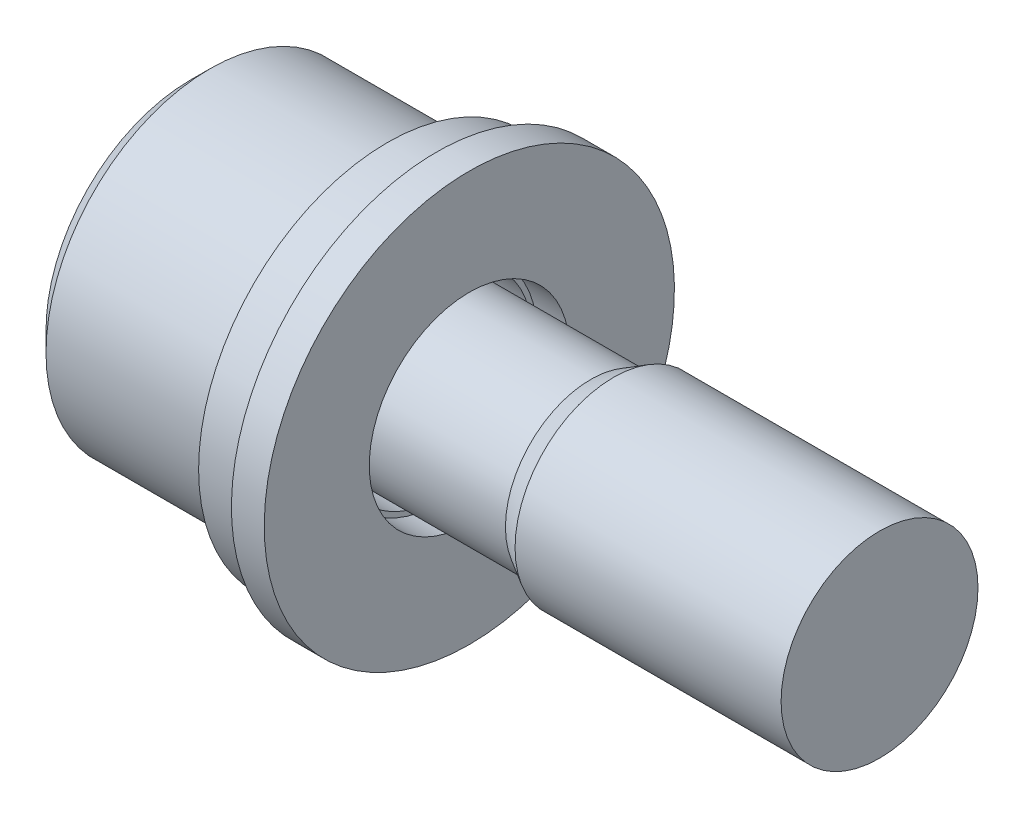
ISO-10303-21;
HEADER;
FILE_DESCRIPTION(('STEP AP214'),'2;1');
FILE_NAME('part.step','',(''),(''),'','','');
FILE_SCHEMA(('AUTOMOTIVE_DESIGN { 1 0 10303 214 1 1 1 1 }'));
ENDSEC;
DATA;
#1=APPLICATION_CONTEXT('core data for automotive mechanical design processes');
#2=APPLICATION_PROTOCOL_DEFINITION('international standard','automotive_design',2000,#1);
#3=PRODUCT_CONTEXT('',#1,'mechanical');
#4=PRODUCT('Part','Part','',(#3));
#5=PRODUCT_RELATED_PRODUCT_CATEGORY('part','',(#4));
#6=PRODUCT_DEFINITION_FORMATION('','',#4);
#7=PRODUCT_DEFINITION_CONTEXT('part definition',#1,'design');
#8=PRODUCT_DEFINITION('design','',#6,#7);
#9=PRODUCT_DEFINITION_SHAPE('','',#8);
#10=(LENGTH_UNIT() NAMED_UNIT(*) SI_UNIT(.MILLI.,.METRE.));
#11=(NAMED_UNIT(*) PLANE_ANGLE_UNIT() SI_UNIT($,.RADIAN.));
#12=(NAMED_UNIT(*) SI_UNIT($,.STERADIAN.) SOLID_ANGLE_UNIT());
#13=UNCERTAINTY_MEASURE_WITH_UNIT(LENGTH_MEASURE(1.E-05),#10,'distance_accuracy_value','');
#14=(GEOMETRIC_REPRESENTATION_CONTEXT(3) GLOBAL_UNCERTAINTY_ASSIGNED_CONTEXT((#13)) GLOBAL_UNIT_ASSIGNED_CONTEXT((#10,
#11,#12)) REPRESENTATION_CONTEXT('',''));
#15=CARTESIAN_POINT('',(0.,0.,0.));
#16=DIRECTION('',(0.,0.,1.));
#17=DIRECTION('',(1.,0.,0.));
#18=AXIS2_PLACEMENT_3D('',#15,#16,#17);
#19=CARTESIAN_POINT('',(-3.1,5.75,0.));
#20=DIRECTION('',(1.,0.,0.));
#21=DIRECTION('',(0.,1.,0.));
#22=AXIS2_PLACEMENT_3D('',#19,#20,#21);
#23=PLANE('',#22);
#24=CARTESIAN_POINT('',(-3.1,0.,0.));
#25=DIRECTION('',(-1.,0.,0.));
#26=DIRECTION('',(0.,-1.,0.));
#27=AXIS2_PLACEMENT_3D('',#24,#25,#26);
#28=CIRCLE('',#27,5.75);
#29=CARTESIAN_POINT('',(-3.1,-5.75,0.));
#30=VERTEX_POINT('',#29);
#31=EDGE_CURVE('E137',#30,#30,#28,.F.);
#32=ORIENTED_EDGE('',*,*,#31,.F.);
#33=EDGE_LOOP('',(#32));
#34=FACE_BOUND('',#33,.T.);
#35=CARTESIAN_POINT('',(-3.1,0.,0.));
#36=DIRECTION('',(1.,0.,0.));
#37=DIRECTION('',(0.,1.,0.));
#38=AXIS2_PLACEMENT_3D('',#35,#36,#37);
#39=CIRCLE('',#38,5.);
#40=CARTESIAN_POINT('',(-3.1,5.,0.));
#41=VERTEX_POINT('',#40);
#42=EDGE_CURVE('E156',#41,#41,#39,.F.);
#43=ORIENTED_EDGE('',*,*,#42,.F.);
#44=EDGE_LOOP('',(#43));
#45=FACE_BOUND('',#44,.T.);
#46=ADVANCED_FACE('F15',(#34,#45),#23,.F.);
#47=CARTESIAN_POINT('',(-9.1,0.,0.));
#48=DIRECTION('',(-1.,0.,0.));
#49=DIRECTION('',(0.,-1.,0.));
#50=AXIS2_PLACEMENT_3D('',#47,#48,#49);
#51=CYLINDRICAL_SURFACE('',#50,5.75);
#52=ORIENTED_EDGE('',*,*,#31,.T.);
#53=EDGE_LOOP('',(#52));
#54=FACE_BOUND('',#53,.T.);
#55=CARTESIAN_POINT('',(-1.6,0.,0.));
#56=DIRECTION('',(-1.,0.,0.));
#57=DIRECTION('',(0.,-1.,0.));
#58=AXIS2_PLACEMENT_3D('',#55,#56,#57);
#59=CIRCLE('',#58,5.75);
#60=CARTESIAN_POINT('',(-1.6,-5.75,0.));
#61=VERTEX_POINT('',#60);
#62=EDGE_CURVE('E131',#61,#61,#59,.T.);
#63=ORIENTED_EDGE('',*,*,#62,.T.);
#64=EDGE_LOOP('',(#63));
#65=FACE_BOUND('',#64,.T.);
#66=ADVANCED_FACE('F250',(#54,#65),#51,.T.);
#67=CARTESIAN_POINT('',(-1.6,5.75,0.));
#68=DIRECTION('',(1.,0.,0.));
#69=DIRECTION('',(0.,1.,0.));
#70=AXIS2_PLACEMENT_3D('',#67,#68,#69);
#71=PLANE('',#70);
#72=ORIENTED_EDGE('',*,*,#62,.F.);
#73=EDGE_LOOP('',(#72));
#74=FACE_BOUND('',#73,.T.);
#75=CARTESIAN_POINT('',(-1.6,0.,0.));
#76=DIRECTION('',(-1.,0.,0.));
#77=DIRECTION('',(0.,-1.,0.));
#78=AXIS2_PLACEMENT_3D('',#75,#76,#77);
#79=CIRCLE('',#78,6.25);
#80=CARTESIAN_POINT('',(-1.6,-6.25,0.));
#81=VERTEX_POINT('',#80);
#82=EDGE_CURVE('E126',#81,#81,#79,.F.);
#83=ORIENTED_EDGE('',*,*,#82,.F.);
#84=EDGE_LOOP('',(#83));
#85=FACE_BOUND('',#84,.T.);
#86=ADVANCED_FACE('F256',(#74,#85),#71,.F.);
#87=CARTESIAN_POINT('',(-9.1,0.,0.));
#88=DIRECTION('',(-1.,0.,0.));
#89=DIRECTION('',(0.,-1.,0.));
#90=AXIS2_PLACEMENT_3D('',#87,#88,#89);
#91=CYLINDRICAL_SURFACE('',#90,6.25);
#92=ORIENTED_EDGE('',*,*,#82,.T.);
#93=EDGE_LOOP('',(#92));
#94=FACE_BOUND('',#93,.T.);
#95=CARTESIAN_POINT('',(-0.6,0.,0.));
#96=DIRECTION('',(-1.,0.,0.));
#97=DIRECTION('',(0.,-1.,0.));
#98=AXIS2_PLACEMENT_3D('',#95,#96,#97);
#99=CIRCLE('',#98,6.25);
#100=CARTESIAN_POINT('',(-0.6,-6.25,0.));
#101=VERTEX_POINT('',#100);
#102=EDGE_CURVE('E19',#101,#101,#99,.T.);
#103=ORIENTED_EDGE('',*,*,#102,.T.);
#104=EDGE_LOOP('',(#103));
#105=FACE_BOUND('',#104,.T.);
#106=ADVANCED_FACE('F265',(#94,#105),#91,.T.);
#107=CARTESIAN_POINT('',(-0.6,2.6,0.));
#108=DIRECTION('',(-1.,0.,0.));
#109=DIRECTION('',(0.,-1.,0.));
#110=AXIS2_PLACEMENT_3D('',#107,#108,#109);
#111=PLANE('',#110);
#112=CARTESIAN_POINT('',(-0.6,0.,0.));
#113=DIRECTION('',(-1.,0.,0.));
#114=DIRECTION('',(0.,-1.,0.));
#115=AXIS2_PLACEMENT_3D('',#112,#113,#114);
#116=CIRCLE('',#115,3.05);
#117=CARTESIAN_POINT('',(-0.6,-3.05,0.));
#118=VERTEX_POINT('',#117);
#119=EDGE_CURVE('E163',#118,#118,#116,.F.);
#120=ORIENTED_EDGE('',*,*,#119,.F.);
#121=EDGE_LOOP('',(#120));
#122=FACE_BOUND('',#121,.T.);
#123=ORIENTED_EDGE('',*,*,#102,.F.);
#124=EDGE_LOOP('',(#123));
#125=FACE_BOUND('',#124,.T.);
#126=ADVANCED_FACE('F17',(#122,#125),#111,.F.);
#127=CARTESIAN_POINT('',(-9.1,0.,0.));
#128=DIRECTION('',(1.,0.,0.));
#129=DIRECTION('',(0.,1.,0.));
#130=AXIS2_PLACEMENT_3D('',#127,#128,#129);
#131=CYLINDRICAL_SURFACE('',#130,5.);
#132=CARTESIAN_POINT('',(-8.5,0.,0.));
#133=DIRECTION('',(1.,0.,0.));
#134=DIRECTION('',(0.,1.,0.));
#135=AXIS2_PLACEMENT_3D('',#132,#133,#134);
#136=CIRCLE('',#135,5.);
#137=CARTESIAN_POINT('',(-8.5,5.,0.));
#138=VERTEX_POINT('',#137);
#139=EDGE_CURVE('E10',#138,#138,#136,.T.);
#140=ORIENTED_EDGE('',*,*,#139,.T.);
#141=EDGE_LOOP('',(#140));
#142=FACE_BOUND('',#141,.T.);
#143=ORIENTED_EDGE('',*,*,#42,.T.);
#144=EDGE_LOOP('',(#143));
#145=FACE_BOUND('',#144,.T.);
#146=ADVANCED_FACE('F259',(#142,#145),#131,.T.);
#147=CARTESIAN_POINT('',(-6.10000000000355,0.,0.));
#148=DIRECTION('',(-1.,0.,0.));
#149=DIRECTION('',(0.,0.,1.));
#150=AXIS2_PLACEMENT_3D('',#147,#148,#149);
#151=CONICAL_SURFACE('',#150,2.49999999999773,1.04719755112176);
#152=CARTESIAN_POINT('',(-4.65662432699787,5.68431684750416E-11,0.));
#153=VERTEX_POINT('',#152);
#154=VERTEX_LOOP('',#153);
#155=FACE_BOUND('',#154,.T.);
#156=CARTESIAN_POINT('',(-6.10000000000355,0.,0.));
#157=DIRECTION('',(-1.,0.,0.));
#158=DIRECTION('',(0.,0.,1.));
#159=AXIS2_PLACEMENT_3D('',#156,#157,#158);
#160=CIRCLE('',#159,2.49999999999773);
#161=CARTESIAN_POINT('',(-6.10000000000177,2.1650635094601,1.24999999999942));
#162=VERTEX_POINT('',#161);
#163=CARTESIAN_POINT('',(-6.10000000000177,0.,2.49999999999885));
#164=VERTEX_POINT('',#163);
#165=EDGE_CURVE('E104',#162,#164,#160,.F.);
#166=ORIENTED_EDGE('',*,*,#165,.F.);
#167=CARTESIAN_POINT('',(-6.10000000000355,0.,0.));
#168=DIRECTION('',(-1.,0.,0.));
#169=DIRECTION('',(0.,0.,1.));
#170=AXIS2_PLACEMENT_3D('',#167,#168,#169);
#171=CIRCLE('',#170,2.49999999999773);
#172=CARTESIAN_POINT('',(-6.10000000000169,2.16506350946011,-1.24999999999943));
#173=VERTEX_POINT('',#172);
#174=EDGE_CURVE('E93',#173,#162,#171,.F.);
#175=ORIENTED_EDGE('',*,*,#174,.F.);
#176=CARTESIAN_POINT('',(-6.10000000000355,0.,0.));
#177=DIRECTION('',(-1.,0.,0.));
#178=DIRECTION('',(0.,0.,1.));
#179=AXIS2_PLACEMENT_3D('',#176,#177,#178);
#180=CIRCLE('',#179,2.49999999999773);
#181=CARTESIAN_POINT('',(-6.10000000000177,0.,-2.49999999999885));
#182=VERTEX_POINT('',#181);
#183=EDGE_CURVE('E92',#182,#173,#180,.F.);
#184=ORIENTED_EDGE('',*,*,#183,.F.);
#185=CARTESIAN_POINT('',(-6.10000000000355,0.,0.));
#186=DIRECTION('',(-1.,0.,0.));
#187=DIRECTION('',(0.,0.,1.));
#188=AXIS2_PLACEMENT_3D('',#185,#186,#187);
#189=CIRCLE('',#188,2.49999999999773);
#190=CARTESIAN_POINT('',(-6.10000000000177,-2.1650635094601,-1.24999999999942));
#191=VERTEX_POINT('',#190);
#192=EDGE_CURVE('E145',#191,#182,#189,.F.);
#193=ORIENTED_EDGE('',*,*,#192,.F.);
#194=CARTESIAN_POINT('',(-6.10000000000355,0.,0.));
#195=DIRECTION('',(-1.,0.,0.));
#196=DIRECTION('',(0.,0.,1.));
#197=AXIS2_PLACEMENT_3D('',#194,#195,#196);
#198=CIRCLE('',#197,2.49999999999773);
#199=CARTESIAN_POINT('',(-6.10000000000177,-2.1650635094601,1.24999999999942));
#200=VERTEX_POINT('',#199);
#201=EDGE_CURVE('E148',#200,#191,#198,.F.);
#202=ORIENTED_EDGE('',*,*,#201,.F.);
#203=CARTESIAN_POINT('',(-6.10000000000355,0.,0.));
#204=DIRECTION('',(-1.,0.,0.));
#205=DIRECTION('',(0.,0.,1.));
#206=AXIS2_PLACEMENT_3D('',#203,#204,#205);
#207=CIRCLE('',#206,2.49999999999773);
#208=EDGE_CURVE('E151',#164,#200,#207,.F.);
#209=ORIENTED_EDGE('',*,*,#208,.F.);
#210=EDGE_LOOP('',(#166,#175,#184,#193,#202,#209));
#211=FACE_BOUND('',#210,.T.);
#212=ADVANCED_FACE('F205',(#155,#211),#151,.F.);
#213=CARTESIAN_POINT('',(-6.1,0.,0.));
#214=DIRECTION('',(-1.,0.,0.));
#215=DIRECTION('',(0.,0.,1.));
#216=AXIS2_PLACEMENT_3D('',#213,#214,#215);
#217=PLANE('',#216);
#218=ORIENTED_EDGE('',*,*,#174,.T.);
#219=DIRECTION('',(0.,-0.5,0.866025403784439));
#220=VECTOR('',#219,1.);
#221=CARTESIAN_POINT('',(-6.09999999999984,1.44337567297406,2.5));
#222=LINE('',#221,#220);
#223=CARTESIAN_POINT('',(-6.09999999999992,2.88675134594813,0.));
#224=VERTEX_POINT('',#223);
#225=EDGE_CURVE('E125',#162,#224,#222,.F.);
#226=ORIENTED_EDGE('',*,*,#225,.T.);
#227=DIRECTION('',(0.,0.5,0.866025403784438));
#228=VECTOR('',#227,1.);
#229=CARTESIAN_POINT('',(-6.1,2.88675134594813,0.));
#230=LINE('',#229,#228);
#231=EDGE_CURVE('E98',#224,#173,#230,.F.);
#232=ORIENTED_EDGE('',*,*,#231,.T.);
#233=EDGE_LOOP('',(#218,#226,#232));
#234=FACE_BOUND('',#233,.T.);
#235=ADVANCED_FACE('F354',(#234),#217,.T.);
#236=CARTESIAN_POINT('',(-6.1,0.,0.));
#237=DIRECTION('',(-1.,0.,0.));
#238=DIRECTION('',(0.,0.,1.));
#239=AXIS2_PLACEMENT_3D('',#236,#237,#238);
#240=PLANE('',#239);
#241=DIRECTION('',(0.,1.,0.));
#242=VECTOR('',#241,1.);
#243=CARTESIAN_POINT('',(-6.1,0.,-2.5));
#244=LINE('',#243,#242);
#245=CARTESIAN_POINT('',(-6.09999999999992,1.44337567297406,-2.5));
#246=VERTEX_POINT('',#245);
#247=EDGE_CURVE('E89',#246,#182,#244,.F.);
#248=ORIENTED_EDGE('',*,*,#247,.T.);
#249=ORIENTED_EDGE('',*,*,#183,.T.);
#250=DIRECTION('',(0.,0.5,0.866025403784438));
#251=VECTOR('',#250,1.);
#252=CARTESIAN_POINT('',(-6.09999999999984,2.88675134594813,0.));
#253=LINE('',#252,#251);
#254=EDGE_CURVE('E94',#173,#246,#253,.F.);
#255=ORIENTED_EDGE('',*,*,#254,.T.);
#256=EDGE_LOOP('',(#248,#249,#255));
#257=FACE_BOUND('',#256,.T.);
#258=ADVANCED_FACE('F356',(#257),#240,.T.);
#259=CARTESIAN_POINT('',(-6.1,0.,0.));
#260=DIRECTION('',(-1.,0.,0.));
#261=DIRECTION('',(0.,0.,1.));
#262=AXIS2_PLACEMENT_3D('',#259,#260,#261);
#263=PLANE('',#262);
#264=DIRECTION('',(0.,-0.499999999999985,0.866025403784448));
#265=VECTOR('',#264,1.);
#266=CARTESIAN_POINT('',(-6.1,-1.44337567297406,-2.5));
#267=LINE('',#266,#265);
#268=CARTESIAN_POINT('',(-6.09999999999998,-1.44337567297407,-2.49999999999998));
#269=VERTEX_POINT('',#268);
#270=EDGE_CURVE('E101',#269,#191,#267,.T.);
#271=ORIENTED_EDGE('',*,*,#270,.T.);
#272=ORIENTED_EDGE('',*,*,#192,.T.);
#273=DIRECTION('',(0.,1.,0.));
#274=VECTOR('',#273,1.);
#275=CARTESIAN_POINT('',(-6.1,0.,-2.49999999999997));
#276=LINE('',#275,#274);
#277=EDGE_CURVE('E105',#182,#269,#276,.F.);
#278=ORIENTED_EDGE('',*,*,#277,.T.);
#279=EDGE_LOOP('',(#271,#272,#278));
#280=FACE_BOUND('',#279,.T.);
#281=ADVANCED_FACE('F210',(#280),#263,.T.);
#282=CARTESIAN_POINT('',(-6.1,0.,0.));
#283=DIRECTION('',(-1.,0.,0.));
#284=DIRECTION('',(0.,0.,1.));
#285=AXIS2_PLACEMENT_3D('',#282,#283,#284);
#286=PLANE('',#285);
#287=DIRECTION('',(0.,-0.5,-0.866025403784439));
#288=VECTOR('',#287,1.);
#289=CARTESIAN_POINT('',(-6.1,-2.88675134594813,0.));
#290=LINE('',#289,#288);
#291=CARTESIAN_POINT('',(-6.09999999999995,-2.88675134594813,0.));
#292=VERTEX_POINT('',#291);
#293=EDGE_CURVE('E63',#292,#200,#290,.F.);
#294=ORIENTED_EDGE('',*,*,#293,.T.);
#295=ORIENTED_EDGE('',*,*,#201,.T.);
#296=DIRECTION('',(0.,0.5,-0.866025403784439));
#297=VECTOR('',#296,1.);
#298=CARTESIAN_POINT('',(-6.09999999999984,-1.44337567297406,-2.5));
#299=LINE('',#298,#297);
#300=EDGE_CURVE('E67',#191,#292,#299,.F.);
#301=ORIENTED_EDGE('',*,*,#300,.T.);
#302=EDGE_LOOP('',(#294,#295,#301));
#303=FACE_BOUND('',#302,.T.);
#304=ADVANCED_FACE('F192',(#303),#286,.T.);
#305=CARTESIAN_POINT('',(-6.1,0.,0.));
#306=DIRECTION('',(-1.,0.,0.));
#307=DIRECTION('',(0.,0.,1.));
#308=AXIS2_PLACEMENT_3D('',#305,#306,#307);
#309=PLANE('',#308);
#310=DIRECTION('',(0.,1.,0.));
#311=VECTOR('',#310,1.);
#312=CARTESIAN_POINT('',(-6.1,0.,2.5));
#313=LINE('',#312,#311);
#314=CARTESIAN_POINT('',(-6.09999999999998,-1.44337567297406,2.5));
#315=VERTEX_POINT('',#314);
#316=EDGE_CURVE('E108',#315,#164,#313,.T.);
#317=ORIENTED_EDGE('',*,*,#316,.T.);
#318=ORIENTED_EDGE('',*,*,#208,.T.);
#319=DIRECTION('',(0.,0.499999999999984,0.866025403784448));
#320=VECTOR('',#319,1.);
#321=CARTESIAN_POINT('',(-6.1,-2.16506350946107,1.24999999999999));
#322=LINE('',#321,#320);
#323=EDGE_CURVE('E111',#200,#315,#322,.T.);
#324=ORIENTED_EDGE('',*,*,#323,.T.);
#325=EDGE_LOOP('',(#317,#318,#324));
#326=FACE_BOUND('',#325,.T.);
#327=ADVANCED_FACE('F238',(#326),#309,.T.);
#328=CARTESIAN_POINT('',(-6.1,0.,0.));
#329=DIRECTION('',(-1.,0.,0.));
#330=DIRECTION('',(0.,0.,1.));
#331=AXIS2_PLACEMENT_3D('',#328,#329,#330);
#332=PLANE('',#331);
#333=DIRECTION('',(0.,0.499999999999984,-0.866025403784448));
#334=VECTOR('',#333,1.);
#335=CARTESIAN_POINT('',(-6.1,1.44337567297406,2.5));
#336=LINE('',#335,#334);
#337=CARTESIAN_POINT('',(-6.09999999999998,1.44337567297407,2.49999999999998));
#338=VERTEX_POINT('',#337);
#339=EDGE_CURVE('E114',#338,#162,#336,.T.);
#340=ORIENTED_EDGE('',*,*,#339,.T.);
#341=ORIENTED_EDGE('',*,*,#165,.T.);
#342=DIRECTION('',(0.,1.,0.));
#343=VECTOR('',#342,1.);
#344=CARTESIAN_POINT('',(-6.1,0.,2.49999999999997));
#345=LINE('',#344,#343);
#346=EDGE_CURVE('E117',#164,#338,#345,.T.);
#347=ORIENTED_EDGE('',*,*,#346,.T.);
#348=EDGE_LOOP('',(#340,#341,#347));
#349=FACE_BOUND('',#348,.T.);
#350=ADVANCED_FACE('F232',(#349),#332,.T.);
#351=CARTESIAN_POINT('',(-6.1,1.44337567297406,2.5));
#352=DIRECTION('',(0.,0.866025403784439,0.5));
#353=DIRECTION('',(0.,-0.5,0.866025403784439));
#354=AXIS2_PLACEMENT_3D('',#351,#352,#353);
#355=PLANE('',#354);
#356=ORIENTED_EDGE('',*,*,#225,.F.);
#357=ORIENTED_EDGE('',*,*,#339,.F.);
#358=DIRECTION('',(1.,0.,0.));
#359=VECTOR('',#358,1.);
#360=CARTESIAN_POINT('',(-6.1,1.44337567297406,2.5));
#361=LINE('',#360,#359);
#362=CARTESIAN_POINT('',(-9.1,1.44337567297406,2.5));
#363=VERTEX_POINT('',#362);
#364=EDGE_CURVE('E33',#363,#338,#361,.T.);
#365=ORIENTED_EDGE('',*,*,#364,.F.);
#366=DIRECTION('',(0.,0.5,-0.866025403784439));
#367=VECTOR('',#366,1.);
#368=CARTESIAN_POINT('',(-9.1,1.44337567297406,2.5));
#369=LINE('',#368,#367);
#370=CARTESIAN_POINT('',(-9.1,2.88675134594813,0.));
#371=VERTEX_POINT('',#370);
#372=EDGE_CURVE('E140',#363,#371,#369,.T.);
#373=ORIENTED_EDGE('',*,*,#372,.T.);
#374=DIRECTION('',(1.,0.,0.));
#375=VECTOR('',#374,1.);
#376=CARTESIAN_POINT('',(-6.1,2.88675134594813,0.));
#377=LINE('',#376,#375);
#378=EDGE_CURVE('E183',#224,#371,#377,.F.);
#379=ORIENTED_EDGE('',*,*,#378,.F.);
#380=EDGE_LOOP('',(#356,#357,#365,#373,#379));
#381=FACE_BOUND('',#380,.T.);
#382=ADVANCED_FACE('F236',(#381),#355,.F.);
#383=CARTESIAN_POINT('',(-6.1,2.88675134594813,0.));
#384=DIRECTION('',(0.,0.866025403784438,-0.5));
#385=DIRECTION('',(0.,0.5,0.866025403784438));
#386=AXIS2_PLACEMENT_3D('',#383,#384,#385);
#387=PLANE('',#386);
#388=ORIENTED_EDGE('',*,*,#254,.F.);
#389=ORIENTED_EDGE('',*,*,#231,.F.);
#390=ORIENTED_EDGE('',*,*,#378,.T.);
#391=DIRECTION('',(0.,-0.5,-0.866025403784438));
#392=VECTOR('',#391,1.);
#393=CARTESIAN_POINT('',(-9.1,2.88675134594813,0.));
#394=LINE('',#393,#392);
#395=CARTESIAN_POINT('',(-9.1,1.44337567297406,-2.5));
#396=VERTEX_POINT('',#395);
#397=EDGE_CURVE('E85',#371,#396,#394,.T.);
#398=ORIENTED_EDGE('',*,*,#397,.T.);
#399=DIRECTION('',(-1.,0.,0.));
#400=VECTOR('',#399,1.);
#401=CARTESIAN_POINT('',(-6.1,1.44337567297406,-2.5));
#402=LINE('',#401,#400);
#403=EDGE_CURVE('E97',#396,#246,#402,.F.);
#404=ORIENTED_EDGE('',*,*,#403,.T.);
#405=EDGE_LOOP('',(#388,#389,#390,#398,#404));
#406=FACE_BOUND('',#405,.T.);
#407=ADVANCED_FACE('F350',(#406),#387,.F.);
#408=CARTESIAN_POINT('',(-6.1,1.44337567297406,-2.5));
#409=DIRECTION('',(0.,0.,-1.));
#410=DIRECTION('',(-1.,0.,0.));
#411=AXIS2_PLACEMENT_3D('',#408,#409,#410);
#412=PLANE('',#411);
#413=ORIENTED_EDGE('',*,*,#277,.F.);
#414=ORIENTED_EDGE('',*,*,#247,.F.);
#415=ORIENTED_EDGE('',*,*,#403,.F.);
#416=DIRECTION('',(0.,1.,0.));
#417=VECTOR('',#416,1.);
#418=CARTESIAN_POINT('',(-9.1,4.399,-2.5));
#419=LINE('',#418,#417);
#420=CARTESIAN_POINT('',(-9.1,-1.44337567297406,-2.5));
#421=VERTEX_POINT('',#420);
#422=EDGE_CURVE('E83',#396,#421,#419,.F.);
#423=ORIENTED_EDGE('',*,*,#422,.T.);
#424=DIRECTION('',(1.,0.,0.));
#425=VECTOR('',#424,1.);
#426=CARTESIAN_POINT('',(-6.1,-1.44337567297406,-2.5));
#427=LINE('',#426,#425);
#428=EDGE_CURVE('E82',#421,#269,#427,.T.);
#429=ORIENTED_EDGE('',*,*,#428,.T.);
#430=EDGE_LOOP('',(#413,#414,#415,#423,#429));
#431=FACE_BOUND('',#430,.T.);
#432=ADVANCED_FACE('F347',(#431),#412,.F.);
#433=CARTESIAN_POINT('',(-6.1,-1.44337567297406,-2.5));
#434=DIRECTION('',(0.,-0.866025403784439,-0.5));
#435=DIRECTION('',(0.,0.5,-0.866025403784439));
#436=AXIS2_PLACEMENT_3D('',#433,#434,#435);
#437=PLANE('',#436);
#438=ORIENTED_EDGE('',*,*,#300,.F.);
#439=ORIENTED_EDGE('',*,*,#270,.F.);
#440=ORIENTED_EDGE('',*,*,#428,.F.);
#441=DIRECTION('',(0.,-0.5,0.866025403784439));
#442=VECTOR('',#441,1.);
#443=CARTESIAN_POINT('',(-9.1,-1.44337567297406,-2.5));
#444=LINE('',#443,#442);
#445=CARTESIAN_POINT('',(-9.1,-2.88675134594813,0.));
#446=VERTEX_POINT('',#445);
#447=EDGE_CURVE('E74',#421,#446,#444,.T.);
#448=ORIENTED_EDGE('',*,*,#447,.T.);
#449=DIRECTION('',(1.,0.,0.));
#450=VECTOR('',#449,1.);
#451=CARTESIAN_POINT('',(-6.1,-2.88675134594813,0.));
#452=LINE('',#451,#450);
#453=EDGE_CURVE('E55',#446,#292,#452,.T.);
#454=ORIENTED_EDGE('',*,*,#453,.T.);
#455=EDGE_LOOP('',(#438,#439,#440,#448,#454));
#456=FACE_BOUND('',#455,.T.);
#457=ADVANCED_FACE('F79',(#456),#437,.F.);
#458=CARTESIAN_POINT('',(-6.1,-2.88675134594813,0.));
#459=DIRECTION('',(0.,-0.866025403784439,0.5));
#460=DIRECTION('',(0.,-0.5,-0.866025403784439));
#461=AXIS2_PLACEMENT_3D('',#458,#459,#460);
#462=PLANE('',#461);
#463=ORIENTED_EDGE('',*,*,#323,.F.);
#464=ORIENTED_EDGE('',*,*,#293,.F.);
#465=ORIENTED_EDGE('',*,*,#453,.F.);
#466=DIRECTION('',(0.,0.5,0.866025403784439));
#467=VECTOR('',#466,1.);
#468=CARTESIAN_POINT('',(-9.1,-2.88675134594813,0.));
#469=LINE('',#468,#467);
#470=CARTESIAN_POINT('',(-9.1,-1.44337567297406,2.5));
#471=VERTEX_POINT('',#470);
#472=EDGE_CURVE('E60',#446,#471,#469,.T.);
#473=ORIENTED_EDGE('',*,*,#472,.T.);
#474=DIRECTION('',(1.,0.,0.));
#475=VECTOR('',#474,1.);
#476=CARTESIAN_POINT('',(-6.1,-1.44337567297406,2.5));
#477=LINE('',#476,#475);
#478=EDGE_CURVE('E122',#471,#315,#477,.T.);
#479=ORIENTED_EDGE('',*,*,#478,.T.);
#480=EDGE_LOOP('',(#463,#464,#465,#473,#479));
#481=FACE_BOUND('',#480,.T.);
#482=ADVANCED_FACE('F58',(#481),#462,.F.);
#483=CARTESIAN_POINT('',(-6.1,-1.44337567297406,2.5));
#484=DIRECTION('',(0.,0.,1.));
#485=DIRECTION('',(0.,-1.,0.));
#486=AXIS2_PLACEMENT_3D('',#483,#484,#485);
#487=PLANE('',#486);
#488=ORIENTED_EDGE('',*,*,#346,.F.);
#489=ORIENTED_EDGE('',*,*,#316,.F.);
#490=ORIENTED_EDGE('',*,*,#478,.F.);
#491=DIRECTION('',(0.,1.,0.));
#492=VECTOR('',#491,1.);
#493=CARTESIAN_POINT('',(-9.1,4.399,2.5));
#494=LINE('',#493,#492);
#495=EDGE_CURVE('E77',#471,#363,#494,.T.);
#496=ORIENTED_EDGE('',*,*,#495,.T.);
#497=ORIENTED_EDGE('',*,*,#364,.T.);
#498=EDGE_LOOP('',(#488,#489,#490,#496,#497));
#499=FACE_BOUND('',#498,.T.);
#500=ADVANCED_FACE('F235',(#499),#487,.F.);
#501=CARTESIAN_POINT('',(-9.1,4.399,0.));
#502=DIRECTION('',(1.,0.,0.));
#503=DIRECTION('',(0.,1.,0.));
#504=AXIS2_PLACEMENT_3D('',#501,#502,#503);
#505=PLANE('',#504);
#506=CARTESIAN_POINT('',(-9.1,0.,0.));
#507=DIRECTION('',(1.,0.,0.));
#508=DIRECTION('',(0.,1.,0.));
#509=AXIS2_PLACEMENT_3D('',#506,#507,#508);
#510=CIRCLE('',#509,4.4);
#511=CARTESIAN_POINT('',(-9.1,4.4,0.));
#512=VERTEX_POINT('',#511);
#513=EDGE_CURVE('E25',#512,#512,#510,.F.);
#514=ORIENTED_EDGE('',*,*,#513,.T.);
#515=EDGE_LOOP('',(#514));
#516=FACE_BOUND('',#515,.T.);
#517=ORIENTED_EDGE('',*,*,#495,.F.);
#518=ORIENTED_EDGE('',*,*,#472,.F.);
#519=ORIENTED_EDGE('',*,*,#447,.F.);
#520=ORIENTED_EDGE('',*,*,#422,.F.);
#521=ORIENTED_EDGE('',*,*,#397,.F.);
#522=ORIENTED_EDGE('',*,*,#372,.F.);
#523=EDGE_LOOP('',(#517,#518,#519,#520,#521,#522));
#524=FACE_BOUND('',#523,.T.);
#525=ADVANCED_FACE('F72',(#516,#524),#505,.F.);
#526=CARTESIAN_POINT('',(-9.1,0.,0.));
#527=DIRECTION('',(1.,0.,0.));
#528=DIRECTION('',(0.,1.,0.));
#529=AXIS2_PLACEMENT_3D('',#526,#527,#528);
#530=CONICAL_SURFACE('',#529,4.4,0.785398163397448);
#531=ORIENTED_EDGE('',*,*,#139,.F.);
#532=EDGE_LOOP('',(#531));
#533=FACE_BOUND('',#532,.T.);
#534=ORIENTED_EDGE('',*,*,#513,.F.);
#535=EDGE_LOOP('',(#534));
#536=FACE_BOUND('',#535,.T.);
#537=ADVANCED_FACE('F320',(#533,#536),#530,.T.);
#538=CARTESIAN_POINT('',(-1.6,0.,0.));
#539=DIRECTION('',(1.,0.,0.));
#540=DIRECTION('',(0.,1.,0.));
#541=AXIS2_PLACEMENT_3D('',#538,#539,#540);
#542=CYLINDRICAL_SURFACE('',#541,3.05);
#543=CARTESIAN_POINT('',(-1.6,0.,0.));
#544=DIRECTION('',(1.,0.,0.));
#545=DIRECTION('',(0.,1.,0.));
#546=AXIS2_PLACEMENT_3D('',#543,#544,#545);
#547=CIRCLE('',#546,3.05);
#548=CARTESIAN_POINT('',(-1.6,3.05,0.));
#549=VERTEX_POINT('',#548);
#550=EDGE_CURVE('E120',#549,#549,#547,.T.);
#551=ORIENTED_EDGE('',*,*,#550,.F.);
#552=EDGE_LOOP('',(#551));
#553=FACE_BOUND('',#552,.T.);
#554=ORIENTED_EDGE('',*,*,#119,.T.);
#555=EDGE_LOOP('',(#554));
#556=FACE_BOUND('',#555,.T.);
#557=ADVANCED_FACE('F317',(#553,#556),#542,.F.);
#558=CARTESIAN_POINT('',(-1.6,0.,0.));
#559=DIRECTION('',(1.,0.,0.));
#560=DIRECTION('',(0.,1.,0.));
#561=AXIS2_PLACEMENT_3D('',#558,#559,#560);
#562=PLANE('',#561);
#563=CARTESIAN_POINT('',(-1.6,0.,0.));
#564=DIRECTION('',(1.,0.,0.));
#565=DIRECTION('',(0.,1.,0.));
#566=AXIS2_PLACEMENT_3D('',#563,#564,#565);
#567=CIRCLE('',#566,2.9);
#568=CARTESIAN_POINT('',(-1.6,2.9,0.));
#569=VERTEX_POINT('',#568);
#570=EDGE_CURVE('E161',#569,#569,#567,.T.);
#571=ORIENTED_EDGE('',*,*,#570,.F.);
#572=EDGE_LOOP('',(#571));
#573=FACE_BOUND('',#572,.T.);
#574=ORIENTED_EDGE('',*,*,#550,.T.);
#575=EDGE_LOOP('',(#574));
#576=FACE_BOUND('',#575,.T.);
#577=ADVANCED_FACE('F309',(#573,#576),#562,.T.);
#578=CARTESIAN_POINT('',(-3.1,0.,0.));
#579=DIRECTION('',(1.,0.,0.));
#580=DIRECTION('',(0.,1.,0.));
#581=AXIS2_PLACEMENT_3D('',#578,#579,#580);
#582=CYLINDRICAL_SURFACE('',#581,2.9);
#583=CARTESIAN_POINT('',(-3.1,0.,0.));
#584=DIRECTION('',(1.,0.,0.));
#585=DIRECTION('',(0.,1.,0.));
#586=AXIS2_PLACEMENT_3D('',#583,#584,#585);
#587=CIRCLE('',#586,2.9);
#588=CARTESIAN_POINT('',(-3.1,2.9,0.));
#589=VERTEX_POINT('',#588);
#590=EDGE_CURVE('E164',#589,#589,#587,.T.);
#591=CARTESIAN_POINT('',(-1.6,2.9,0.));
#592=CARTESIAN_POINT('',(-1.615625,2.9,0.));
#593=CARTESIAN_POINT('',(-1.63125,2.9,0.));
#594=CARTESIAN_POINT('',(-1.6625,2.9,0.));
#595=CARTESIAN_POINT('',(-1.678125,2.9,0.));
#596=CARTESIAN_POINT('',(-1.709375,2.9,0.));
#597=CARTESIAN_POINT('',(-1.725,2.9,0.));
#598=CARTESIAN_POINT('',(-1.75625,2.9,0.));
#599=CARTESIAN_POINT('',(-1.771875,2.9,0.));
#600=CARTESIAN_POINT('',(-1.803125,2.9,0.));
#601=CARTESIAN_POINT('',(-1.81875,2.9,0.));
#602=CARTESIAN_POINT('',(-1.85,2.9,0.));
#603=CARTESIAN_POINT('',(-1.865625,2.9,0.));
#604=CARTESIAN_POINT('',(-1.896875,2.9,0.));
#605=CARTESIAN_POINT('',(-1.9125,2.9,0.));
#606=CARTESIAN_POINT('',(-1.94375,2.9,0.));
#607=CARTESIAN_POINT('',(-1.959375,2.9,0.));
#608=CARTESIAN_POINT('',(-1.990625,2.9,0.));
#609=CARTESIAN_POINT('',(-2.00625,2.9,0.));
#610=CARTESIAN_POINT('',(-2.0375,2.9,0.));
#611=CARTESIAN_POINT('',(-2.053125,2.9,0.));
#612=CARTESIAN_POINT('',(-2.084375,2.9,0.));
#613=CARTESIAN_POINT('',(-2.1,2.9,0.));
#614=CARTESIAN_POINT('',(-2.13125,2.9,0.));
#615=CARTESIAN_POINT('',(-2.146875,2.9,0.));
#616=CARTESIAN_POINT('',(-2.178125,2.9,0.));
#617=CARTESIAN_POINT('',(-2.19375,2.9,0.));
#618=CARTESIAN_POINT('',(-2.225,2.9,0.));
#619=CARTESIAN_POINT('',(-2.240625,2.9,0.));
#620=CARTESIAN_POINT('',(-2.271875,2.9,0.));
#621=CARTESIAN_POINT('',(-2.2875,2.9,0.));
#622=CARTESIAN_POINT('',(-2.31875,2.9,0.));
#623=CARTESIAN_POINT('',(-2.334375,2.9,0.));
#624=CARTESIAN_POINT('',(-2.365625,2.9,0.));
#625=CARTESIAN_POINT('',(-2.38125,2.9,0.));
#626=CARTESIAN_POINT('',(-2.4125,2.9,0.));
#627=CARTESIAN_POINT('',(-2.428125,2.9,0.));
#628=CARTESIAN_POINT('',(-2.459375,2.9,0.));
#629=CARTESIAN_POINT('',(-2.475,2.9,0.));
#630=CARTESIAN_POINT('',(-2.50625,2.9,0.));
#631=CARTESIAN_POINT('',(-2.521875,2.9,0.));
#632=CARTESIAN_POINT('',(-2.553125,2.9,0.));
#633=CARTESIAN_POINT('',(-2.56875,2.9,0.));
#634=CARTESIAN_POINT('',(-2.6,2.9,0.));
#635=CARTESIAN_POINT('',(-2.615625,2.9,0.));
#636=CARTESIAN_POINT('',(-2.646875,2.9,0.));
#637=CARTESIAN_POINT('',(-2.6625,2.9,0.));
#638=CARTESIAN_POINT('',(-2.69375,2.9,0.));
#639=CARTESIAN_POINT('',(-2.709375,2.9,0.));
#640=CARTESIAN_POINT('',(-2.740625,2.9,0.));
#641=CARTESIAN_POINT('',(-2.75625,2.9,0.));
#642=CARTESIAN_POINT('',(-2.7875,2.9,0.));
#643=CARTESIAN_POINT('',(-2.803125,2.9,0.));
#644=CARTESIAN_POINT('',(-2.834375,2.9,0.));
#645=CARTESIAN_POINT('',(-2.85,2.9,0.));
#646=CARTESIAN_POINT('',(-2.88125,2.9,0.));
#647=CARTESIAN_POINT('',(-2.896875,2.9,0.));
#648=CARTESIAN_POINT('',(-2.928125,2.9,0.));
#649=CARTESIAN_POINT('',(-2.94375,2.9,0.));
#650=CARTESIAN_POINT('',(-2.975,2.9,0.));
#651=CARTESIAN_POINT('',(-2.990625,2.9,0.));
#652=CARTESIAN_POINT('',(-3.021875,2.9,0.));
#653=CARTESIAN_POINT('',(-3.0375,2.9,0.));
#654=CARTESIAN_POINT('',(-3.06875,2.9,0.));
#655=CARTESIAN_POINT('',(-3.084375,2.9,0.));
#656=CARTESIAN_POINT('',(-3.1,2.9,0.));
#657=B_SPLINE_CURVE_WITH_KNOTS('',3,(#591,#592,#593,#594,#595,#596,#597,#598,#599,#600,#601,
#602,#603,#604,#605,#606,#607,#608,#609,#610,#611,#612,#613,#614,#615,#616,#617,#618,#619,#620,
#621,#622,#623,#624,#625,#626,#627,#628,#629,#630,#631,#632,#633,#634,#635,#636,#637,#638,#639,
#640,#641,#642,#643,#644,#645,#646,#647,#648,#649,#650,#651,#652,#653,#654,#655,#656),
.UNSPECIFIED.,.F.,.F.,(4,2,2,2,2,2,2,2,2,2,2,2,2,2,2,2,2,2,2,2,2,2,2,2,2,2,2,2,2,2,2,2,4),(0.,
0.046875,0.0937500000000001,0.140625,0.1875,0.234375,0.28125,0.328125,0.375,0.421875,0.46875,
0.515625,0.5625,0.609375,0.65625,0.703125,0.75,0.796875,0.84375,0.890625,0.9375,0.984375,
1.03125,1.078125,1.125,1.171875,1.21875,1.265625,1.3125,1.359375,1.40625,1.453125,1.5),.UNSPECIFIED.);
#658=EDGE_CURVE('BSEAM301',#569,#589,#657,.T.);
#659=ORIENTED_EDGE('',*,*,#570,.T.);
#660=ORIENTED_EDGE('',*,*,#590,.F.);
#661=ORIENTED_EDGE('',*,*,#658,.T.);
#662=ORIENTED_EDGE('',*,*,#658,.F.);
#663=EDGE_LOOP('',(#659,#661,#660,#662));
#664=FACE_BOUND('',#663,.T.);
#665=ADVANCED_FACE('F301',(#664),#582,.F.);
#666=CARTESIAN_POINT('',(-3.1,0.,0.));
#667=DIRECTION('',(1.,0.,0.));
#668=DIRECTION('',(0.,1.,0.));
#669=AXIS2_PLACEMENT_3D('',#666,#667,#668);
#670=PLANE('',#669);
#671=CARTESIAN_POINT('',(-3.1,0.,0.));
#672=DIRECTION('',(1.,0.,0.));
#673=DIRECTION('',(0.,1.,0.));
#674=AXIS2_PLACEMENT_3D('',#671,#672,#673);
#675=CIRCLE('',#674,2.6);
#676=CARTESIAN_POINT('',(-3.1,2.6,0.));
#677=VERTEX_POINT('',#676);
#678=EDGE_CURVE('E488',#677,#677,#675,.T.);
#679=ORIENTED_EDGE('',*,*,#678,.F.);
#680=EDGE_LOOP('',(#679));
#681=FACE_BOUND('',#680,.T.);
#682=ORIENTED_EDGE('',*,*,#590,.T.);
#683=EDGE_LOOP('',(#682));
#684=FACE_BOUND('',#683,.T.);
#685=ADVANCED_FACE('F296',(#681,#684),#670,.T.);
#686=CARTESIAN_POINT('',(11.9,3.,0.));
#687=DIRECTION('',(-1.,0.,0.));
#688=DIRECTION('',(0.,-1.,0.));
#689=AXIS2_PLACEMENT_3D('',#686,#687,#688);
#690=PLANE('',#689);
#691=CARTESIAN_POINT('',(11.9,0.,0.));
#692=DIRECTION('',(-1.,0.,0.));
#693=DIRECTION('',(0.,0.,1.));
#694=AXIS2_PLACEMENT_3D('',#691,#692,#693);
#695=CIRCLE('',#694,3.);
#696=CARTESIAN_POINT('',(11.9,0.,3.));
#697=VERTEX_POINT('',#696);
#698=EDGE_CURVE('E134',#697,#697,#695,.T.);
#699=ORIENTED_EDGE('',*,*,#698,.F.);
#700=EDGE_LOOP('',(#699));
#701=FACE_BOUND('',#700,.T.);
#702=ADVANCED_FACE('F293',(#701),#690,.F.);
#703=CARTESIAN_POINT('',(-7.14838709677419,0.,0.));
#704=DIRECTION('',(-1.,0.,0.));
#705=DIRECTION('',(0.,0.,1.));
#706=AXIS2_PLACEMENT_3D('',#703,#704,#705);
#707=CYLINDRICAL_SURFACE('',#706,3.);
#708=CARTESIAN_POINT('',(3.79282032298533,0.,0.));
#709=DIRECTION('',(1.,0.,0.));
#710=DIRECTION('',(0.,0.,-1.));
#711=AXIS2_PLACEMENT_3D('',#708,#709,#710);
#712=CIRCLE('',#711,2.9999999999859);
#713=CARTESIAN_POINT('',(3.79282032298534,0.,-2.9999999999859));
#714=VERTEX_POINT('',#713);
#715=EDGE_CURVE('E130',#714,#714,#712,.F.);
#716=ORIENTED_EDGE('',*,*,#715,.F.);
#717=EDGE_LOOP('',(#716));
#718=FACE_BOUND('',#717,.T.);
#719=ORIENTED_EDGE('',*,*,#698,.T.);
#720=EDGE_LOOP('',(#719));
#721=FACE_BOUND('',#720,.T.);
#722=ADVANCED_FACE('F289',(#718,#721),#707,.T.);
#723=CARTESIAN_POINT('',(3.79282032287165,0.,0.));
#724=DIRECTION('',(1.,0.,0.));
#725=DIRECTION('',(0.,0.,-1.));
#726=AXIS2_PLACEMENT_3D('',#723,#724,#725);
#727=CONICAL_SURFACE('',#726,2.99999999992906,0.523598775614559);
#728=ORIENTED_EDGE('',*,*,#715,.T.);
#729=EDGE_LOOP('',(#728));
#730=FACE_BOUND('',#729,.T.);
#731=CARTESIAN_POINT('',(3.1,0.,0.));
#732=DIRECTION('',(-1.,0.,0.));
#733=DIRECTION('',(0.,0.,1.));
#734=AXIS2_PLACEMENT_3D('',#731,#732,#733);
#735=CIRCLE('',#734,2.6);
#736=CARTESIAN_POINT('',(3.1,0.,2.6));
#737=VERTEX_POINT('',#736);
#738=EDGE_CURVE('E129',#737,#737,#735,.T.);
#739=ORIENTED_EDGE('',*,*,#738,.F.);
#740=EDGE_LOOP('',(#739));
#741=FACE_BOUND('',#740,.T.);
#742=ADVANCED_FACE('F287',(#730,#741),#727,.T.);
#743=CARTESIAN_POINT('',(-7.14838709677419,0.,0.));
#744=DIRECTION('',(-1.,0.,0.));
#745=DIRECTION('',(0.,0.,1.));
#746=AXIS2_PLACEMENT_3D('',#743,#744,#745);
#747=CYLINDRICAL_SURFACE('',#746,2.6);
#748=ORIENTED_EDGE('',*,*,#738,.T.);
#749=EDGE_LOOP('',(#748));
#750=FACE_BOUND('',#749,.T.);
#751=ORIENTED_EDGE('',*,*,#678,.T.);
#752=EDGE_LOOP('',(#751));
#753=FACE_BOUND('',#752,.T.);
#754=ADVANCED_FACE('F286',(#750,#753),#747,.T.);
#755=CLOSED_SHELL('',(#46,#66,#86,#106,#126,#146,#212,#235,#258,#281,#304,#327,#350,#382,#407,
#432,#457,#482,#500,#525,#537,#557,#577,#665,#685,#702,#722,#742,#754));
#756=MANIFOLD_SOLID_BREP('B1',#755);
#757=ADVANCED_BREP_SHAPE_REPRESENTATION('',(#18,#756),#14);
#758=SHAPE_DEFINITION_REPRESENTATION(#9,#757);
ENDSEC;
END-ISO-10303-21;
